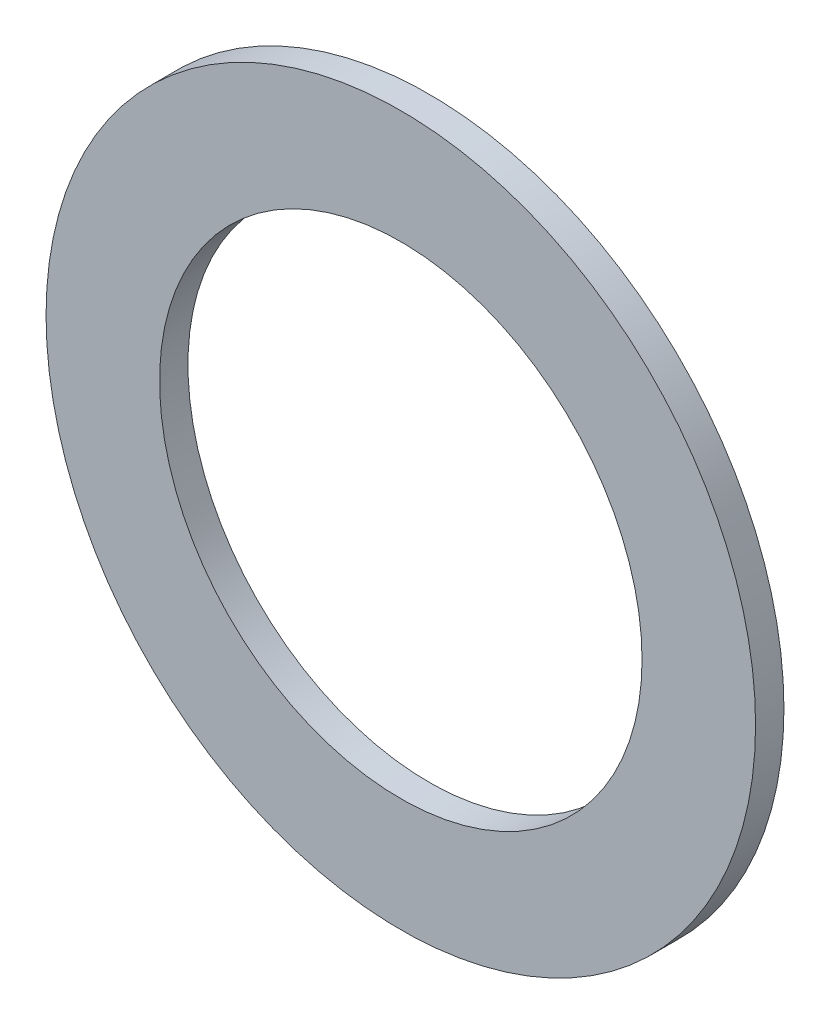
ISO-10303-21;
HEADER;
FILE_DESCRIPTION(('STEP AP214'),'2;1');
FILE_NAME('part.step','',(''),(''),'','','');
FILE_SCHEMA(('AUTOMOTIVE_DESIGN { 1 0 10303 214 1 1 1 1 }'));
ENDSEC;
DATA;
#1=APPLICATION_CONTEXT('core data for automotive mechanical design processes');
#2=APPLICATION_PROTOCOL_DEFINITION('international standard','automotive_design',2000,#1);
#3=PRODUCT_CONTEXT('',#1,'mechanical');
#4=PRODUCT('Part','Part','',(#3));
#5=PRODUCT_RELATED_PRODUCT_CATEGORY('part','',(#4));
#6=PRODUCT_DEFINITION_FORMATION('','',#4);
#7=PRODUCT_DEFINITION_CONTEXT('part definition',#1,'design');
#8=PRODUCT_DEFINITION('design','',#6,#7);
#9=PRODUCT_DEFINITION_SHAPE('','',#8);
#10=(LENGTH_UNIT() NAMED_UNIT(*) SI_UNIT(.MILLI.,.METRE.));
#11=(NAMED_UNIT(*) PLANE_ANGLE_UNIT() SI_UNIT($,.RADIAN.));
#12=(NAMED_UNIT(*) SI_UNIT($,.STERADIAN.) SOLID_ANGLE_UNIT());
#13=UNCERTAINTY_MEASURE_WITH_UNIT(LENGTH_MEASURE(1.E-05),#10,'distance_accuracy_value','');
#14=(GEOMETRIC_REPRESENTATION_CONTEXT(3) GLOBAL_UNCERTAINTY_ASSIGNED_CONTEXT((#13)) GLOBAL_UNIT_ASSIGNED_CONTEXT((#10,
#11,#12)) REPRESENTATION_CONTEXT('',''));
#15=CARTESIAN_POINT('',(0.,0.,0.));
#16=DIRECTION('',(0.,0.,1.));
#17=DIRECTION('',(1.,0.,0.));
#18=AXIS2_PLACEMENT_3D('',#15,#16,#17);
#19=CARTESIAN_POINT('',(0.,0.,2.));
#20=DIRECTION('',(0.,0.,1.));
#21=DIRECTION('',(1.,0.,0.));
#22=AXIS2_PLACEMENT_3D('',#19,#20,#21);
#23=PLANE('',#22);
#24=CARTESIAN_POINT('',(0.,0.,2.));
#25=DIRECTION('',(0.,0.,1.));
#26=DIRECTION('',(1.,0.,0.));
#27=AXIS2_PLACEMENT_3D('',#24,#25,#26);
#28=CIRCLE('',#27,25.);
#29=CARTESIAN_POINT('',(25.,0.,2.));
#30=VERTEX_POINT('',#29);
#31=EDGE_CURVE('E10',#30,#30,#28,.T.);
#32=ORIENTED_EDGE('',*,*,#31,.T.);
#33=EDGE_LOOP('',(#32));
#34=FACE_BOUND('',#33,.T.);
#35=CARTESIAN_POINT('',(0.,0.,2.));
#36=DIRECTION('',(0.,0.,1.));
#37=DIRECTION('',(1.,0.,0.));
#38=AXIS2_PLACEMENT_3D('',#35,#36,#37);
#39=CIRCLE('',#38,17.);
#40=CARTESIAN_POINT('',(17.,0.,2.));
#41=VERTEX_POINT('',#40);
#42=EDGE_CURVE('E42',#41,#41,#39,.T.);
#43=ORIENTED_EDGE('',*,*,#42,.F.);
#44=EDGE_LOOP('',(#43));
#45=FACE_BOUND('',#44,.T.);
#46=ADVANCED_FACE('F31',(#34,#45),#23,.T.);
#47=CARTESIAN_POINT('',(0.,0.,0.));
#48=DIRECTION('',(0.,0.,1.));
#49=DIRECTION('',(1.,0.,0.));
#50=AXIS2_PLACEMENT_3D('',#47,#48,#49);
#51=PLANE('',#50);
#52=CARTESIAN_POINT('',(0.,0.,0.));
#53=DIRECTION('',(0.,0.,1.));
#54=DIRECTION('',(1.,0.,0.));
#55=AXIS2_PLACEMENT_3D('',#52,#53,#54);
#56=CIRCLE('',#55,25.);
#57=CARTESIAN_POINT('',(25.,0.,0.));
#58=VERTEX_POINT('',#57);
#59=EDGE_CURVE('E38',#58,#58,#56,.T.);
#60=ORIENTED_EDGE('',*,*,#59,.F.);
#61=EDGE_LOOP('',(#60));
#62=FACE_BOUND('',#61,.T.);
#63=CARTESIAN_POINT('',(0.,0.,0.));
#64=DIRECTION('',(0.,0.,1.));
#65=DIRECTION('',(1.,0.,0.));
#66=AXIS2_PLACEMENT_3D('',#63,#64,#65);
#67=CIRCLE('',#66,17.);
#68=CARTESIAN_POINT('',(17.,0.,0.));
#69=VERTEX_POINT('',#68);
#70=EDGE_CURVE('E46',#69,#69,#67,.T.);
#71=ORIENTED_EDGE('',*,*,#70,.T.);
#72=EDGE_LOOP('',(#71));
#73=FACE_BOUND('',#72,.T.);
#74=ADVANCED_FACE('F52',(#62,#73),#51,.F.);
#75=CARTESIAN_POINT('',(0.,0.,2.));
#76=DIRECTION('',(0.,0.,-1.));
#77=DIRECTION('',(-1.,0.,0.));
#78=AXIS2_PLACEMENT_3D('',#75,#76,#77);
#79=CYLINDRICAL_SURFACE('',#78,25.);
#80=ORIENTED_EDGE('',*,*,#31,.F.);
#81=EDGE_LOOP('',(#80));
#82=FACE_BOUND('',#81,.T.);
#83=ORIENTED_EDGE('',*,*,#59,.T.);
#84=EDGE_LOOP('',(#83));
#85=FACE_BOUND('',#84,.T.);
#86=ADVANCED_FACE('F33',(#82,#85),#79,.T.);
#87=CARTESIAN_POINT('',(0.,0.,2.));
#88=DIRECTION('',(0.,0.,-1.));
#89=DIRECTION('',(-1.,0.,0.));
#90=AXIS2_PLACEMENT_3D('',#87,#88,#89);
#91=CYLINDRICAL_SURFACE('',#90,17.);
#92=ORIENTED_EDGE('',*,*,#42,.T.);
#93=EDGE_LOOP('',(#92));
#94=FACE_BOUND('',#93,.T.);
#95=ORIENTED_EDGE('',*,*,#70,.F.);
#96=EDGE_LOOP('',(#95));
#97=FACE_BOUND('',#96,.T.);
#98=ADVANCED_FACE('F54',(#94,#97),#91,.F.);
#99=CLOSED_SHELL('',(#46,#74,#86,#98));
#100=MANIFOLD_SOLID_BREP('B2',#99);
#101=ADVANCED_BREP_SHAPE_REPRESENTATION('',(#18,#100),#14);
#102=SHAPE_DEFINITION_REPRESENTATION(#9,#101);
ENDSEC;
END-ISO-10303-21;
